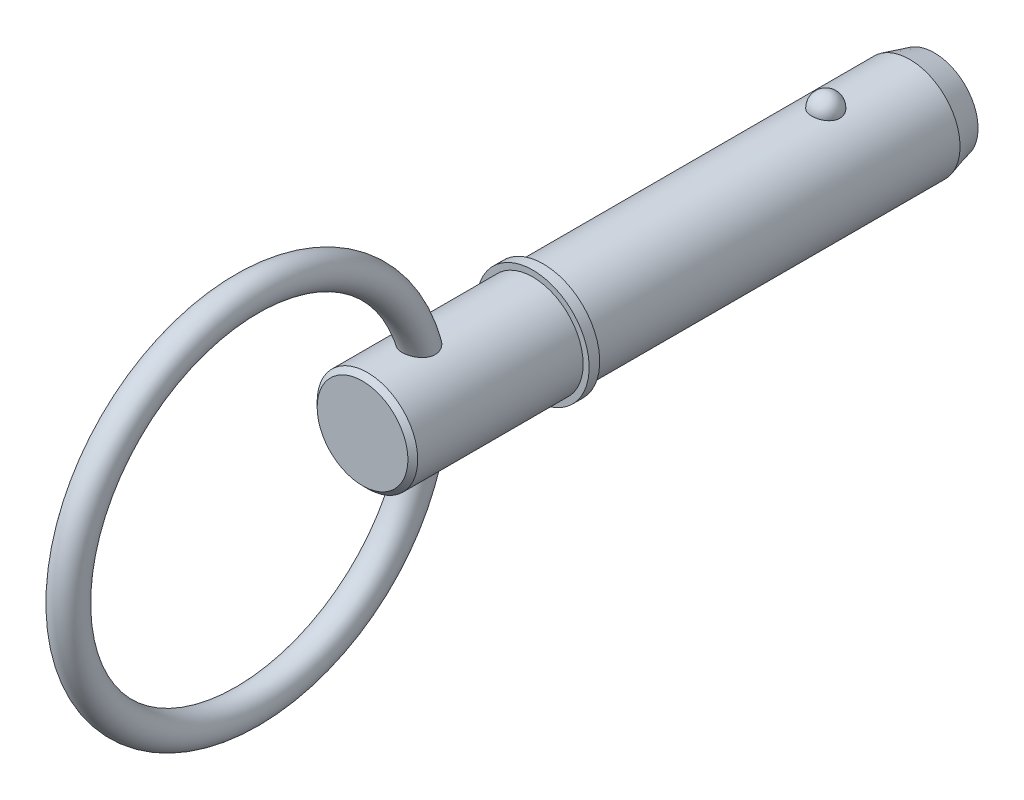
ISO-10303-21;
HEADER;
FILE_DESCRIPTION(('STEP AP214'),'2;1');
FILE_NAME('part.step','',(''),(''),'','','');
FILE_SCHEMA(('AUTOMOTIVE_DESIGN { 1 0 10303 214 1 1 1 1 }'));
ENDSEC;
DATA;
#1=APPLICATION_CONTEXT('core data for automotive mechanical design processes');
#2=APPLICATION_PROTOCOL_DEFINITION('international standard','automotive_design',2000,#1);
#3=PRODUCT_CONTEXT('',#1,'mechanical');
#4=PRODUCT('Part','Part','',(#3));
#5=PRODUCT_RELATED_PRODUCT_CATEGORY('part','',(#4));
#6=PRODUCT_DEFINITION_FORMATION('','',#4);
#7=PRODUCT_DEFINITION_CONTEXT('part definition',#1,'design');
#8=PRODUCT_DEFINITION('design','',#6,#7);
#9=PRODUCT_DEFINITION_SHAPE('','',#8);
#10=(LENGTH_UNIT() NAMED_UNIT(*) SI_UNIT(.MILLI.,.METRE.));
#11=(NAMED_UNIT(*) PLANE_ANGLE_UNIT() SI_UNIT($,.RADIAN.));
#12=(NAMED_UNIT(*) SI_UNIT($,.STERADIAN.) SOLID_ANGLE_UNIT());
#13=UNCERTAINTY_MEASURE_WITH_UNIT(LENGTH_MEASURE(1.E-05),#10,'distance_accuracy_value','');
#14=(GEOMETRIC_REPRESENTATION_CONTEXT(3) GLOBAL_UNCERTAINTY_ASSIGNED_CONTEXT((#13)) GLOBAL_UNIT_ASSIGNED_CONTEXT((#10,
#11,#12)) REPRESENTATION_CONTEXT('',''));
#15=CARTESIAN_POINT('',(0.,0.,0.));
#16=DIRECTION('',(0.,0.,1.));
#17=DIRECTION('',(1.,0.,0.));
#18=AXIS2_PLACEMENT_3D('',#15,#16,#17);
#19=CARTESIAN_POINT('',(0.,0.,38.1));
#20=DIRECTION('',(0.,0.,-1.));
#21=DIRECTION('',(-1.,0.,0.));
#22=AXIS2_PLACEMENT_3D('',#19,#20,#21);
#23=CYLINDRICAL_SURFACE('',#22,7.145);
#24=CARTESIAN_POINT('',(1.99971637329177,6.85945766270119,-2.02));
#25=CARTESIAN_POINT('',(1.9997145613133,6.85945924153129,-1.9070973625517));
#26=CARTESIAN_POINT('',(1.99051486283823,6.86216053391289,-1.79417185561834));
#27=CARTESIAN_POINT('',(1.95393597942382,6.87266409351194,-1.57152267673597));
#28=CARTESIAN_POINT('',(1.92655029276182,6.88046818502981,-1.46180016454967));
#29=CARTESIAN_POINT('',(1.85429435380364,6.90029063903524,-1.24873107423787));
#30=CARTESIAN_POINT('',(1.80943177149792,6.91230715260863,-1.14538172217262));
#31=CARTESIAN_POINT('',(1.70333474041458,6.93921158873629,-0.947875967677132));
#32=CARTESIAN_POINT('',(1.64210059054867,6.95409945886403,-0.853719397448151));
#33=CARTESIAN_POINT('',(1.5044381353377,6.98517577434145,-0.676721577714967));
#34=CARTESIAN_POINT('',(1.42793505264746,7.00137037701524,-0.593939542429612));
#35=CARTESIAN_POINT('',(1.26189697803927,7.03319066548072,-0.442536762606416));
#36=CARTESIAN_POINT('',(1.17236198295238,7.04881635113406,-0.373916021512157));
#37=CARTESIAN_POINT('',(0.982932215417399,7.0777121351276,-0.252935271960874));
#38=CARTESIAN_POINT('',(0.883068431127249,7.09098897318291,-0.2005284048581));
#39=CARTESIAN_POINT('',(0.675560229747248,7.11375589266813,-0.113212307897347));
#40=CARTESIAN_POINT('',(0.567916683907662,7.12324639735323,-0.0783011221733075));
#41=CARTESIAN_POINT('',(0.350006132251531,7.13724173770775,-0.0274707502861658));
#42=CARTESIAN_POINT('',(0.239822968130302,7.14183447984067,-0.0112162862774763));
#43=CARTESIAN_POINT('',(0.0181946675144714,7.14583597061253,0.0029679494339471));
#44=CARTESIAN_POINT('',(-0.0932503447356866,7.14524522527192,0.000899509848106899));
#45=CARTESIAN_POINT('',(-0.312527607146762,7.13899247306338,-0.0213331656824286));
#46=CARTESIAN_POINT('',(-0.420388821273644,7.13340426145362,-0.0412340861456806));
#47=CARTESIAN_POINT('',(-0.631141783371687,7.11785474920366,-0.0982040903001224));
#48=CARTESIAN_POINT('',(-0.734033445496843,7.10789337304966,-0.13527347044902));
#49=CARTESIAN_POINT('',(-0.932634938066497,7.08458058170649,-0.225826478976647));
#50=CARTESIAN_POINT('',(-1.02829911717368,7.07120963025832,-0.279405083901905));
#51=CARTESIAN_POINT('',(-1.20927180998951,7.04252043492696,-0.401457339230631));
#52=CARTESIAN_POINT('',(-1.29457925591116,7.02720199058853,-0.469932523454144));
#53=CARTESIAN_POINT('',(-1.45423311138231,6.995926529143,-0.62143818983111));
#54=CARTESIAN_POINT('',(-1.5283348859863,6.97996288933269,-0.704725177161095));
#55=CARTESIAN_POINT('',(-1.66169281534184,6.94942414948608,-0.882667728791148));
#56=CARTESIAN_POINT('',(-1.72094789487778,6.93484915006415,-0.977324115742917));
#57=CARTESIAN_POINT('',(-1.82375276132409,6.90853186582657,-1.17661373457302));
#58=CARTESIAN_POINT('',(-1.86711024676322,6.8968248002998,-1.28135093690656));
#59=CARTESIAN_POINT('',(-1.9360425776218,6.87779420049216,-1.49689986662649));
#60=CARTESIAN_POINT('',(-1.96161794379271,6.87047053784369,-1.60771141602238));
#61=CARTESIAN_POINT('',(-1.99427437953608,6.86106309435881,-1.83176258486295));
#62=CARTESIAN_POINT('',(-2.00143373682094,6.8589571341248,-1.9449898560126));
#63=CARTESIAN_POINT('',(-1.99730449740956,6.86016064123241,-2.17107603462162));
#64=CARTESIAN_POINT('',(-1.98601641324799,6.86346995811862,-2.28393495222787));
#65=CARTESIAN_POINT('',(-1.94538181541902,6.87509649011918,-2.5054843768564));
#66=CARTESIAN_POINT('',(-1.91612773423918,6.88338806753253,-2.61419321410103));
#67=CARTESIAN_POINT('',(-1.84036449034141,6.90402888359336,-2.8250124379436));
#68=CARTESIAN_POINT('',(-1.79385462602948,6.91637828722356,-2.92712255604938));
#69=CARTESIAN_POINT('',(-1.68442067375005,6.94384180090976,-3.12247704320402));
#70=CARTESIAN_POINT('',(-1.62140729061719,6.95897081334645,-3.21566929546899));
#71=CARTESIAN_POINT('',(-1.4806650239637,6.99026742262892,-3.38999412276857));
#72=CARTESIAN_POINT('',(-1.40293556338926,7.00643506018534,-3.47112622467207));
#73=CARTESIAN_POINT('',(-1.2344320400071,7.03807960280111,-3.61938672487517));
#74=CARTESIAN_POINT('',(-1.1436092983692,7.05355363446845,-3.68646046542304));
#75=CARTESIAN_POINT('',(-0.951591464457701,7.08201263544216,-3.80431973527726));
#76=CARTESIAN_POINT('',(-0.850397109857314,7.09499778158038,-3.85510642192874));
#77=CARTESIAN_POINT('',(-0.641823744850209,7.11687679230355,-3.93839532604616));
#78=CARTESIAN_POINT('',(-0.534539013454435,7.1258202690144,-3.97112042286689));
#79=CARTESIAN_POINT('',(-0.315743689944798,7.1388605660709,-4.01830716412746));
#80=CARTESIAN_POINT('',(-0.204233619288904,7.14295798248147,-4.0327710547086));
#81=CARTESIAN_POINT('',(0.0175518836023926,7.14582273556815,-4.04291389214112));
#82=CARTESIAN_POINT('',(0.127809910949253,7.14469090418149,-4.03894819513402));
#83=CARTESIAN_POINT('',(0.346044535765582,7.13745046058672,-4.01315850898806));
#84=CARTESIAN_POINT('',(0.454021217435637,7.13134203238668,-3.99133518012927));
#85=CARTESIAN_POINT('',(0.664227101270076,7.11483713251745,-3.93057164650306));
#86=CARTESIAN_POINT('',(0.76647723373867,7.10445761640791,-3.89169908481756));
#87=CARTESIAN_POINT('',(0.962929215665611,7.08050813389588,-3.79792023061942));
#88=CARTESIAN_POINT('',(1.05713054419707,7.06693796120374,-3.7430129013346));
#89=CARTESIAN_POINT('',(1.23644031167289,7.03780007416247,-3.61765173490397));
#90=CARTESIAN_POINT('',(1.32138387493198,7.0222044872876,-3.54696861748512));
#91=CARTESIAN_POINT('',(1.47830582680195,6.99085504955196,-3.39245228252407));
#92=CARTESIAN_POINT('',(1.55028198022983,6.97510117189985,-3.30861680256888));
#93=CARTESIAN_POINT('',(1.68063701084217,6.94485803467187,-3.12843058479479));
#94=CARTESIAN_POINT('',(1.73875175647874,6.93039619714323,-3.03188405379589));
#95=CARTESIAN_POINT('',(1.83823393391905,6.90467783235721,-2.83015210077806));
#96=CARTESIAN_POINT('',(1.87960712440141,6.89342020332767,-2.72496966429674));
#97=CARTESIAN_POINT('',(1.94111647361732,6.87633596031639,-2.52050234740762));
#98=CARTESIAN_POINT('',(1.96305249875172,6.87005682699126,-2.42179225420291));
#99=CARTESIAN_POINT('',(1.99235308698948,6.86161702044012,-2.22206084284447));
#100=CARTESIAN_POINT('',(1.99971799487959,6.85945624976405,-2.12103957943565));
#101=CARTESIAN_POINT('',(1.99971637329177,6.85945766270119,-2.02));
#102=B_SPLINE_CURVE_WITH_KNOTS('',3,(#24,#25,#26,#27,#28,#29,#30,#31,#32,#33,#34,#35,#36,#37,
#38,#39,#40,#41,#42,#43,#44,#45,#46,#47,#48,#49,#50,#51,#52,#53,#54,#55,#56,#57,#58,#59,#60,#61,
#62,#63,#64,#65,#66,#67,#68,#69,#70,#71,#72,#73,#74,#75,#76,#77,#78,#79,#80,#81,#82,#83,#84,#85,
#86,#87,#88,#89,#90,#91,#92,#93,#94,#95,#96,#97,#98,#99,#100,#101),.UNSPECIFIED.,.T.,.F.,(4,2,2,
2,2,2,2,2,2,2,2,2,2,2,2,2,2,2,2,2,2,2,2,2,2,2,2,2,2,2,2,2,2,2,2,2,2,2,4),(0.,0.338345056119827,
0.67681114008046,1.01512885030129,1.35344038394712,1.69345130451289,2.0334623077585,
2.37248128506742,2.71146235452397,3.04425125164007,3.37700766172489,3.70493009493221,
4.03285819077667,4.36270921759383,4.69259422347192,5.02887632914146,5.36518278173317,
5.70543263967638,6.04567253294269,6.38446363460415,6.72324532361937,7.0602984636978,
7.39736530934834,7.73629500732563,8.07523799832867,8.4154752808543,8.75568838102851,
9.09160363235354,9.42747756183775,9.7569023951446,10.0863150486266,10.4144324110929,
10.7425709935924,11.0758313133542,11.4091490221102,11.748385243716,12.0875046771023,
12.3903058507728,12.6930998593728),.UNSPECIFIED.);
#103=CARTESIAN_POINT('',(1.99971637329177,6.85945766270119,-2.02));
#104=VERTEX_POINT('',#103);
#105=EDGE_CURVE('E103',#104,#104,#102,.T.);
#106=ORIENTED_EDGE('',*,*,#105,.T.);
#107=EDGE_LOOP('',(#106));
#108=FACE_BOUND('',#107,.T.);
#109=CARTESIAN_POINT('',(0.,0.,-13.95));
#110=DIRECTION('',(0.,0.,-1.));
#111=DIRECTION('',(-1.,0.,0.));
#112=AXIS2_PLACEMENT_3D('',#109,#110,#111);
#113=CIRCLE('',#112,7.145);
#114=CARTESIAN_POINT('',(-7.145,0.,-13.95));
#115=VERTEX_POINT('',#114);
#116=EDGE_CURVE('E110',#115,#115,#113,.F.);
#117=ORIENTED_EDGE('',*,*,#116,.T.);
#118=EDGE_LOOP('',(#117));
#119=FACE_BOUND('',#118,.T.);
#120=CARTESIAN_POINT('',(0.,0.,38.1));
#121=DIRECTION('',(0.,0.,1.));
#122=DIRECTION('',(1.,0.,0.));
#123=AXIS2_PLACEMENT_3D('',#120,#121,#122);
#124=CIRCLE('',#123,7.145);
#125=CARTESIAN_POINT('',(7.145,0.,38.1));
#126=VERTEX_POINT('',#125);
#127=EDGE_CURVE('E108',#126,#126,#124,.T.);
#128=ORIENTED_EDGE('',*,*,#127,.F.);
#129=EDGE_LOOP('',(#128));
#130=FACE_BOUND('',#129,.T.);
#131=ADVANCED_FACE('F39',(#108,#119,#130),#23,.T.);
#132=CARTESIAN_POINT('',(0.,0.,-17.45));
#133=DIRECTION('',(0.,0.,-1.));
#134=DIRECTION('',(-1.,0.,0.));
#135=AXIS2_PLACEMENT_3D('',#132,#133,#134);
#136=PLANE('',#135);
#137=CARTESIAN_POINT('',(0.,0.,-17.45));
#138=DIRECTION('',(0.,0.,-1.));
#139=DIRECTION('',(-1.,0.,0.));
#140=AXIS2_PLACEMENT_3D('',#137,#138,#139);
#141=CIRCLE('',#140,6.20717782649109);
#142=CARTESIAN_POINT('',(-6.20717782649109,0.,-17.45));
#143=VERTEX_POINT('',#142);
#144=EDGE_CURVE('E142',#143,#143,#141,.T.);
#145=ORIENTED_EDGE('',*,*,#144,.T.);
#146=EDGE_LOOP('',(#145));
#147=FACE_BOUND('',#146,.T.);
#148=ADVANCED_FACE('F89',(#147),#136,.T.);
#149=CARTESIAN_POINT('',(0.,0.,-17.45));
#150=DIRECTION('',(0.,0.,1.));
#151=DIRECTION('',(1.,0.,0.));
#152=AXIS2_PLACEMENT_3D('',#149,#150,#151);
#153=CONICAL_SURFACE('',#152,6.20717782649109,0.261799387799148);
#154=ORIENTED_EDGE('',*,*,#116,.F.);
#155=EDGE_LOOP('',(#154));
#156=FACE_BOUND('',#155,.T.);
#157=ORIENTED_EDGE('',*,*,#144,.F.);
#158=EDGE_LOOP('',(#157));
#159=FACE_BOUND('',#158,.T.);
#160=ADVANCED_FACE('F95',(#156,#159),#153,.T.);
#161=CARTESIAN_POINT('',(0.,7.145,-2.02));
#162=DIRECTION('',(0.,1.,0.));
#163=DIRECTION('',(0.,0.,1.));
#164=AXIS2_PLACEMENT_3D('',#161,#162,#163);
#165=SPHERICAL_SURFACE('',#164,2.02);
#166=ORIENTED_EDGE('',*,*,#105,.F.);
#167=EDGE_LOOP('',(#166));
#168=FACE_BOUND('',#167,.T.);
#169=ADVANCED_FACE('F113',(#168),#165,.T.);
#170=CARTESIAN_POINT('',(0.,0.,38.1));
#171=DIRECTION('',(0.,0.,-1.));
#172=DIRECTION('',(-1.,0.,0.));
#173=AXIS2_PLACEMENT_3D('',#170,#171,#172);
#174=PLANE('',#173);
#175=ORIENTED_EDGE('',*,*,#127,.T.);
#176=EDGE_LOOP('',(#175));
#177=FACE_BOUND('',#176,.T.);
#178=CARTESIAN_POINT('',(0.,0.,38.1));
#179=DIRECTION('',(0.,0.,-1.));
#180=DIRECTION('',(-1.,0.,0.));
#181=AXIS2_PLACEMENT_3D('',#178,#179,#180);
#182=CIRCLE('',#181,8.);
#183=CARTESIAN_POINT('',(-8.,0.,38.1));
#184=VERTEX_POINT('',#183);
#185=EDGE_CURVE('E109',#184,#184,#182,.T.);
#186=ORIENTED_EDGE('',*,*,#185,.T.);
#187=EDGE_LOOP('',(#186));
#188=FACE_BOUND('',#187,.T.);
#189=ADVANCED_FACE('F117',(#177,#188),#174,.T.);
#190=CARTESIAN_POINT('',(0.,0.,33.7287874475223));
#191=DIRECTION('',(0.,0.,-1.));
#192=DIRECTION('',(-1.,0.,0.));
#193=AXIS2_PLACEMENT_3D('',#190,#191,#192);
#194=CYLINDRICAL_SURFACE('',#193,8.);
#195=CARTESIAN_POINT('',(0.,0.,39.6));
#196=DIRECTION('',(0.,0.,-1.));
#197=DIRECTION('',(-1.,0.,0.));
#198=AXIS2_PLACEMENT_3D('',#195,#196,#197);
#199=CIRCLE('',#198,8.);
#200=CARTESIAN_POINT('',(-8.,0.,39.6));
#201=VERTEX_POINT('',#200);
#202=EDGE_CURVE('E134',#201,#201,#199,.T.);
#203=ORIENTED_EDGE('',*,*,#202,.T.);
#204=EDGE_LOOP('',(#203));
#205=FACE_BOUND('',#204,.T.);
#206=ORIENTED_EDGE('',*,*,#185,.F.);
#207=EDGE_LOOP('',(#206));
#208=FACE_BOUND('',#207,.T.);
#209=ADVANCED_FACE('F121',(#205,#208),#194,.T.);
#210=CARTESIAN_POINT('',(0.,8.,39.6));
#211=DIRECTION('',(0.,0.,1.));
#212=DIRECTION('',(1.,0.,0.));
#213=AXIS2_PLACEMENT_3D('',#210,#211,#212);
#214=PLANE('',#213);
#215=CARTESIAN_POINT('',(0.,0.,39.6));
#216=DIRECTION('',(0.,0.,1.));
#217=DIRECTION('',(1.,0.,0.));
#218=AXIS2_PLACEMENT_3D('',#215,#216,#217);
#219=CIRCLE('',#218,7.145);
#220=CARTESIAN_POINT('',(7.145,0.,39.6));
#221=VERTEX_POINT('',#220);
#222=EDGE_CURVE('E112',#221,#221,#219,.T.);
#223=ORIENTED_EDGE('',*,*,#222,.F.);
#224=EDGE_LOOP('',(#223));
#225=FACE_BOUND('',#224,.T.);
#226=ORIENTED_EDGE('',*,*,#202,.F.);
#227=EDGE_LOOP('',(#226));
#228=FACE_BOUND('',#227,.T.);
#229=ADVANCED_FACE('F86',(#225,#228),#214,.T.);
#230=CARTESIAN_POINT('',(0.,0.,63.8));
#231=DIRECTION('',(0.,0.,-1.));
#232=DIRECTION('',(-1.,0.,0.));
#233=AXIS2_PLACEMENT_3D('',#230,#231,#232);
#234=CYLINDRICAL_SURFACE('',#233,7.145);
#235=CARTESIAN_POINT('',(-1.03551034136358,-7.0695645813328,53.7302593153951));
#236=CARTESIAN_POINT('',(-0.923225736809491,-7.08601142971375,53.674402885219));
#237=CARTESIAN_POINT('',(-0.806039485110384,-7.10042113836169,53.6278354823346));
#238=CARTESIAN_POINT('',(-0.565173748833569,-7.1236385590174,53.5542799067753));
#239=CARTESIAN_POINT('',(-0.441495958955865,-7.13244772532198,53.5272866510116));
#240=CARTESIAN_POINT('',(-0.191106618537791,-7.14354309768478,53.4934505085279));
#241=CARTESIAN_POINT('',(-0.0643945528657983,-7.14582818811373,53.486611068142));
#242=CARTESIAN_POINT('',(0.188443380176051,-7.14363337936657,53.4932414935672));
#243=CARTESIAN_POINT('',(0.314569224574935,-7.13915321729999,53.5067121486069));
#244=CARTESIAN_POINT('',(0.562499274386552,-7.12390574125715,53.5536416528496));
#245=CARTESIAN_POINT('',(0.684308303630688,-7.11314569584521,53.5870773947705));
#246=CARTESIAN_POINT('',(0.920329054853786,-7.08647538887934,53.673194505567));
#247=CARTESIAN_POINT('',(1.03454038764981,-7.07056486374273,53.7258768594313));
#248=CARTESIAN_POINT('',(1.25232634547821,-7.03526161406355,53.8494470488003));
#249=CARTESIAN_POINT('',(1.35588248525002,-7.01586299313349,53.9203658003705));
#250=CARTESIAN_POINT('',(1.54916093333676,-6.9757352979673,54.0787573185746));
#251=CARTESIAN_POINT('',(1.63888414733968,-6.95500631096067,54.1662290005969));
#252=CARTESIAN_POINT('',(1.80113983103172,-6.91475703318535,54.3547277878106));
#253=CARTESIAN_POINT('',(1.8738192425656,-6.89522757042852,54.4556263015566));
#254=CARTESIAN_POINT('',(2.00091178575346,-6.85942834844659,54.66884010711));
#255=CARTESIAN_POINT('',(2.05532963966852,-6.8431577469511,54.7811524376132));
#256=CARTESIAN_POINT('',(2.14350100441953,-6.81604873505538,55.0111948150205));
#257=CARTESIAN_POINT('',(2.17770329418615,-6.80509340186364,55.1287395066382));
#258=CARTESIAN_POINT('',(2.2269139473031,-6.7891497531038,55.368149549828));
#259=CARTESIAN_POINT('',(2.2419216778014,-6.7841616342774,55.4900150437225));
#260=CARTESIAN_POINT('',(2.25313992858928,-6.78044381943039,55.7358069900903));
#261=CARTESIAN_POINT('',(2.24917302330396,-6.78177319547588,55.8597420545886));
#262=CARTESIAN_POINT('',(2.22301329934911,-6.79039131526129,56.1054389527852));
#263=CARTESIAN_POINT('',(2.20081491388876,-6.79768187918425,56.2272001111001));
#264=CARTESIAN_POINT('',(2.13702421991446,-6.81801706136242,56.4752873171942));
#265=CARTESIAN_POINT('',(2.09404815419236,-6.83146790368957,56.6012230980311));
#266=CARTESIAN_POINT('',(1.9898638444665,-6.86253672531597,56.8448244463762));
#267=CARTESIAN_POINT('',(1.92864130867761,-6.88015796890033,56.9624834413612));
#268=CARTESIAN_POINT('',(1.78274362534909,-6.91947130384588,57.1974979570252));
#269=CARTESIAN_POINT('',(1.6964070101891,-6.94139021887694,57.3137892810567));
#270=CARTESIAN_POINT('',(1.50503944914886,-6.98537683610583,57.5297996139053));
#271=CARTESIAN_POINT('',(1.40001969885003,-7.00744444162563,57.629528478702));
#272=CARTESIAN_POINT('',(1.19221781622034,-7.04548349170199,57.793170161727));
#273=CARTESIAN_POINT('',(1.09203347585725,-7.06185586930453,57.8602859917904));
#274=CARTESIAN_POINT('',(0.881607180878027,-7.09119477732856,57.977337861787));
#275=CARTESIAN_POINT('',(0.771372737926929,-7.10416382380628,58.0272866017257));
#276=CARTESIAN_POINT('',(0.542622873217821,-7.12529560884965,58.1074752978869));
#277=CARTESIAN_POINT('',(0.424058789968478,-7.13342692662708,58.1375865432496));
#278=CARTESIAN_POINT('',(0.183155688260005,-7.14366628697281,58.175370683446));
#279=CARTESIAN_POINT('',(0.0608191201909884,-7.14577815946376,58.183057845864));
#280=CARTESIAN_POINT('',(-0.169367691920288,-7.14381572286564,58.1758601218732));
#281=CARTESIAN_POINT('',(-0.277308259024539,-7.14040669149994,58.1634029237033));
#282=CARTESIAN_POINT('',(-0.489468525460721,-7.12900651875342,58.1211569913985));
#283=CARTESIAN_POINT('',(-0.593687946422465,-7.12101503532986,58.0913669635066));
#284=CARTESIAN_POINT('',(-0.796149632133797,-7.10123695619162,58.0159872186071));
#285=CARTESIAN_POINT('',(-0.894373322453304,-7.08943921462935,57.9703510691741));
#286=CARTESIAN_POINT('',(-1.08274371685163,-7.06312621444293,57.8653366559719));
#287=CARTESIAN_POINT('',(-1.17288754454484,-7.04860999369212,57.8059535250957));
#288=CARTESIAN_POINT('',(-1.35484961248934,-7.01605385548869,57.6671134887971));
#289=CARTESIAN_POINT('',(-1.44541008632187,-6.99780069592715,57.5860611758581));
#290=CARTESIAN_POINT('',(-1.61364655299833,-6.96093393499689,57.4115990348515));
#291=CARTESIAN_POINT('',(-1.69131381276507,-6.94232009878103,57.3181809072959));
#292=CARTESIAN_POINT('',(-1.84330074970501,-6.90364386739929,57.1066087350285));
#293=CARTESIAN_POINT('',(-1.91543090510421,-6.88377370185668,56.9868392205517));
#294=CARTESIAN_POINT('',(-2.0400294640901,-6.84788436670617,56.7368759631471));
#295=CARTESIAN_POINT('',(-2.09248830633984,-6.83186707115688,56.6066771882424));
#296=CARTESIAN_POINT('',(-2.17795964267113,-6.80511869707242,56.3325553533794));
#297=CARTESIAN_POINT('',(-2.20992909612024,-6.79467512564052,56.1882740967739));
#298=CARTESIAN_POINT('',(-2.24813111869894,-6.78213595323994,55.8959843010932));
#299=CARTESIAN_POINT('',(-2.25438316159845,-6.78003403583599,55.7479786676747));
#300=CARTESIAN_POINT('',(-2.24011368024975,-6.78475868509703,55.465430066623));
#301=CARTESIAN_POINT('',(-2.22172362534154,-6.79087455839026,55.3307692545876));
#302=CARTESIAN_POINT('',(-2.16145328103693,-6.81029672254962,55.0673673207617));
#303=CARTESIAN_POINT('',(-2.11958615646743,-6.82359898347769,54.9386229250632));
#304=CARTESIAN_POINT('',(-2.01784121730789,-6.85433303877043,54.7022679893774));
#305=CARTESIAN_POINT('',(-1.9598239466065,-6.8713108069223,54.5937922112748));
#306=CARTESIAN_POINT('',(-1.82642155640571,-6.90796511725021,54.3885914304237));
#307=CARTESIAN_POINT('',(-1.75103235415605,-6.92764229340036,54.2918691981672));
#308=CARTESIAN_POINT('',(-1.57825515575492,-6.96911949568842,54.1054086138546));
#309=CARTESIAN_POINT('',(-1.47957996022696,-6.99096237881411,54.0168703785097));
#310=CARTESIAN_POINT('',(-1.26760341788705,-7.0324852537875,53.858840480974));
#311=CARTESIAN_POINT('',(-1.15429989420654,-7.05216492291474,53.7893516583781));
#312=CARTESIAN_POINT('',(-1.03551034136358,-7.0695645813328,53.7302593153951));
#313=B_SPLINE_CURVE_WITH_KNOTS('',3,(#235,#236,#237,#238,#239,#240,#241,#242,#243,#244,#245,
#246,#247,#248,#249,#250,#251,#252,#253,#254,#255,#256,#257,#258,#259,#260,#261,#262,#263,#264,
#265,#266,#267,#268,#269,#270,#271,#272,#273,#274,#275,#276,#277,#278,#279,#280,#281,#282,#283,
#284,#285,#286,#287,#288,#289,#290,#291,#292,#293,#294,#295,#296,#297,#298,#299,#300,#301,#302,
#303,#304,#305,#306,#307,#308,#309,#310,#311,#312),.UNSPECIFIED.,.T.,.F.,(4,2,2,2,2,2,2,2,2,2,2,
2,2,2,2,2,2,2,2,2,2,2,2,2,2,2,2,2,2,2,2,2,2,2,2,2,2,2,4),(0.,0.378979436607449,
0.757860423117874,1.13680619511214,1.51576669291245,1.89428943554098,2.2728315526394,
2.65201969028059,3.03118299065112,3.40694616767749,3.78261210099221,4.1495904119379,
4.51658082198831,4.8870095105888,5.25755134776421,5.65713708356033,6.05703662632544,
6.49445595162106,6.93161403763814,7.29520224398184,7.65852089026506,8.02417421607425,
8.38959483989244,8.71415763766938,9.03874466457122,9.36429093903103,9.68995264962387,
10.0572255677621,10.4247462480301,10.8465602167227,11.2685789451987,11.7106604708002,
12.152407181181,12.5583067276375,12.9639788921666,13.3347314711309,13.7055712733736,
14.1064462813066,14.5073810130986),.UNSPECIFIED.);
#314=CARTESIAN_POINT('',(-1.03551034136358,-7.0695645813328,53.7302593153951));
#315=VERTEX_POINT('',#314);
#316=EDGE_CURVE('E10',#315,#315,#313,.T.);
#317=ORIENTED_EDGE('',*,*,#316,.F.);
#318=EDGE_LOOP('',(#317));
#319=FACE_BOUND('',#318,.T.);
#320=CARTESIAN_POINT('',(-1.03551034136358,7.0695645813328,53.7302593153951));
#321=CARTESIAN_POINT('',(-1.14644953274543,7.05331457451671,53.785446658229));
#322=CARTESIAN_POINT('',(-1.25260902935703,7.03507806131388,53.8497022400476));
#323=CARTESIAN_POINT('',(-1.45240021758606,6.99656564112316,53.9949589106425));
#324=CARTESIAN_POINT('',(-1.54602879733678,6.97628922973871,54.0759641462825));
#325=CARTESIAN_POINT('',(-1.71815091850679,6.93590796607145,54.2529100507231));
#326=CARTESIAN_POINT('',(-1.79663177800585,6.91580327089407,54.3488631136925));
#327=CARTESIAN_POINT('',(-1.9360771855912,6.87807159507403,54.5531625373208));
#328=CARTESIAN_POINT('',(-1.99704642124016,6.86044395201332,54.6615055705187));
#329=CARTESIAN_POINT('',(-2.09894945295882,6.82995115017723,54.8855428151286));
#330=CARTESIAN_POINT('',(-2.14021253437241,6.81700866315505,55.0010768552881));
#331=CARTESIAN_POINT('',(-2.20347311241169,6.79682602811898,55.2377588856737));
#332=CARTESIAN_POINT('',(-2.22547114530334,6.78958572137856,55.3589067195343));
#333=CARTESIAN_POINT('',(-2.25026114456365,6.78140983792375,55.6032142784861));
#334=CARTESIAN_POINT('',(-2.25306986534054,6.78046876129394,55.7263721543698));
#335=CARTESIAN_POINT('',(-2.2403056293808,6.78469532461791,55.9716049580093));
#336=CARTESIAN_POINT('',(-2.22472720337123,6.78986478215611,56.0936795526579));
#337=CARTESIAN_POINT('',(-2.1747213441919,6.8060520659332,56.3420367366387));
#338=CARTESIAN_POINT('',(-2.13910164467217,6.81743831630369,56.4680537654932));
#339=CARTESIAN_POINT('',(-2.04975058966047,6.84483151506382,56.7129736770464));
#340=CARTESIAN_POINT('',(-1.99600968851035,6.86084089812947,56.8318727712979));
#341=CARTESIAN_POINT('',(-1.86558545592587,6.89751014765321,57.0714258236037));
#342=CARTESIAN_POINT('',(-1.78715729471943,6.91847353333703,57.1910877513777));
#343=CARTESIAN_POINT('',(-1.61149373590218,6.96148580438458,57.4156460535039));
#344=CARTESIAN_POINT('',(-1.51424701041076,6.98353533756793,57.5205334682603));
#345=CARTESIAN_POINT('',(-1.30107590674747,7.02639179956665,57.7129518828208));
#346=CARTESIAN_POINT('',(-1.18492282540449,7.04717858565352,57.8002366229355));
#347=CARTESIAN_POINT('',(-0.93739281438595,7.08434208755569,57.9508275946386));
#348=CARTESIAN_POINT('',(-0.806039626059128,7.10072555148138,58.0141705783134));
#349=CARTESIAN_POINT('',(-0.55047080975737,7.12475629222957,58.1054837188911));
#350=CARTESIAN_POINT('',(-0.427643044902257,7.13327781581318,58.1370470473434));
#351=CARTESIAN_POINT('',(-0.24055628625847,7.14122488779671,58.1663563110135));
#352=CARTESIAN_POINT('',(-0.17771410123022,7.14306799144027,58.1731199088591));
#353=CARTESIAN_POINT('',(-0.0516470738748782,7.14509121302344,58.1805390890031));
#354=CARTESIAN_POINT('',(0.0115777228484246,7.14527152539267,58.1811953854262));
#355=CARTESIAN_POINT('',(0.182932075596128,7.14347436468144,58.1746165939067));
#356=CARTESIAN_POINT('',(0.290871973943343,7.13986325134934,58.1614086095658));
#357=CARTESIAN_POINT('',(0.502842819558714,7.1280769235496,58.1176904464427));
#358=CARTESIAN_POINT('',(0.606873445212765,7.11990133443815,58.0871788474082));
#359=CARTESIAN_POINT('',(0.809001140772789,7.09978218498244,58.0103786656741));
#360=CARTESIAN_POINT('',(0.907071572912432,7.08782300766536,57.9640246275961));
#361=CARTESIAN_POINT('',(1.09503957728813,7.0612282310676,57.8576208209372));
#362=CARTESIAN_POINT('',(1.18493426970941,7.04659169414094,57.7975662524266));
#363=CARTESIAN_POINT('',(1.36644041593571,7.01380352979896,57.6572339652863));
#364=CARTESIAN_POINT('',(1.45676563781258,6.99544216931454,57.5753442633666));
#365=CARTESIAN_POINT('',(1.6244063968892,6.95842750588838,57.3992310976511));
#366=CARTESIAN_POINT('',(1.70171298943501,6.93977401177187,57.3049992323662));
#367=CARTESIAN_POINT('',(1.85271606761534,6.90111647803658,57.0918074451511));
#368=CARTESIAN_POINT('',(1.92421731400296,6.88131605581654,56.9712480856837));
#369=CARTESIAN_POINT('',(2.04739198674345,6.84567995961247,56.7197850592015));
#370=CARTESIAN_POINT('',(2.09905621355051,6.82984612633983,56.5888766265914));
#371=CARTESIAN_POINT('',(2.18257767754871,6.80363167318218,56.3138472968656));
#372=CARTESIAN_POINT('',(2.21345394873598,6.79352430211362,56.1693978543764));
#373=CARTESIAN_POINT('',(2.24941288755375,6.78170753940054,55.8769846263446));
#374=CARTESIAN_POINT('',(2.2545156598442,6.77999160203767,55.7290236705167));
#375=CARTESIAN_POINT('',(2.2380435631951,6.78544298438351,55.4470530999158));
#376=CARTESIAN_POINT('',(2.21864521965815,6.79188566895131,55.3129037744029));
#377=CARTESIAN_POINT('',(2.1564876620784,6.81187529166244,55.0506903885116));
#378=CARTESIAN_POINT('',(2.11373989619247,6.82541874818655,54.9226233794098));
#379=CARTESIAN_POINT('',(2.01040099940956,6.85652522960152,54.6875077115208));
#380=CARTESIAN_POINT('',(1.95162600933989,6.87365110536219,54.5795975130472));
#381=CARTESIAN_POINT('',(1.81683142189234,6.91050025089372,54.3756496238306));
#382=CARTESIAN_POINT('',(1.74081238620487,6.93022343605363,54.2796115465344));
#383=CARTESIAN_POINT('',(1.57431234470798,6.96992220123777,54.1025418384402));
#384=CARTESIAN_POINT('',(1.48394688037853,6.98989467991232,54.021400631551));
#385=CARTESIAN_POINT('',(1.29081365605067,7.02812243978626,53.8750381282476));
#386=CARTESIAN_POINT('',(1.18804491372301,7.04637758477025,53.8098180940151));
#387=CARTESIAN_POINT('',(0.970386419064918,7.07967210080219,53.6953776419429));
#388=CARTESIAN_POINT('',(0.855272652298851,7.09462807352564,53.6465586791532));
#389=CARTESIAN_POINT('',(0.618143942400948,7.11920826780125,53.5680711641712));
#390=CARTESIAN_POINT('',(0.496128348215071,7.12883198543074,53.5384044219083));
#391=CARTESIAN_POINT('',(0.247581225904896,7.14180209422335,53.4986987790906));
#392=CARTESIAN_POINT('',(0.121020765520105,7.14509609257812,53.4888236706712));
#393=CARTESIAN_POINT('',(-0.132022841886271,7.14489967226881,53.4894154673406));
#394=CARTESIAN_POINT('',(-0.258506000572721,7.14141109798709,53.4998768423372));
#395=CARTESIAN_POINT('',(-0.496649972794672,7.12862600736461,53.5390533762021));
#396=CARTESIAN_POINT('',(-0.608625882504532,7.11987587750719,53.5660553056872));
#397=CARTESIAN_POINT('',(-0.826925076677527,7.09783467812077,53.6362228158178));
#398=CARTESIAN_POINT('',(-0.933248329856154,7.08454358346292,53.6793884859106));
#399=CARTESIAN_POINT('',(-1.03551034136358,7.0695645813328,53.7302593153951));
#400=B_SPLINE_CURVE_WITH_KNOTS('',3,(#320,#321,#322,#323,#324,#325,#326,#327,#328,#329,#330,
#331,#332,#333,#334,#335,#336,#337,#338,#339,#340,#341,#342,#343,#344,#345,#346,#347,#348,#349,
#350,#351,#352,#353,#354,#355,#356,#357,#358,#359,#360,#361,#362,#363,#364,#365,#366,#367,#368,
#369,#370,#371,#372,#373,#374,#375,#376,#377,#378,#379,#380,#381,#382,#383,#384,#385,#386,#387,
#388,#389,#390,#391,#392,#393,#394,#395,#396,#397,#398,#399),.UNSPECIFIED.,.T.,.F.,(4,2,2,2,2,2,
2,2,2,2,2,2,2,2,2,2,2,2,2,2,2,2,2,2,2,2,2,2,2,2,2,2,2,2,2,2,2,2,2,4),(0.,0.37450428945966,
0.749101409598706,1.12401080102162,1.49881974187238,1.86712525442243,2.23542051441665,
2.60339417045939,2.97147730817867,3.36420696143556,3.7571438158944,4.18898920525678,
4.62109535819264,5.05888124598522,5.49599234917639,5.87475353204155,6.06416800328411,
6.25356032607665,6.57826179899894,6.90298992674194,7.22907626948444,7.55527703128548,
7.92373585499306,8.29244681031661,8.71527472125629,9.13829848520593,9.58009907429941,
10.0215549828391,10.4264139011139,10.831074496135,11.2014904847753,11.571894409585,
11.9394538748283,12.3070424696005,12.6830655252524,13.0591241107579,13.4382822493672,
13.8173372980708,14.1625475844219,14.5077597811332),.UNSPECIFIED.);
#401=CARTESIAN_POINT('',(-1.03551034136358,7.0695645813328,53.7302593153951));
#402=VERTEX_POINT('',#401);
#403=EDGE_CURVE('E51',#402,#402,#400,.T.);
#404=ORIENTED_EDGE('',*,*,#403,.F.);
#405=EDGE_LOOP('',(#404));
#406=FACE_BOUND('',#405,.T.);
#407=CARTESIAN_POINT('',(0.,0.,63.0999999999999));
#408=DIRECTION('',(0.,0.,-1.));
#409=DIRECTION('',(-1.,0.,0.));
#410=AXIS2_PLACEMENT_3D('',#407,#408,#409);
#411=CIRCLE('',#410,7.145);
#412=CARTESIAN_POINT('',(-7.14499999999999,0.,63.1));
#413=VERTEX_POINT('',#412);
#414=EDGE_CURVE('E65',#413,#413,#411,.T.);
#415=ORIENTED_EDGE('',*,*,#414,.T.);
#416=EDGE_LOOP('',(#415));
#417=FACE_BOUND('',#416,.T.);
#418=ORIENTED_EDGE('',*,*,#222,.T.);
#419=EDGE_LOOP('',(#418));
#420=FACE_BOUND('',#419,.T.);
#421=ADVANCED_FACE('F70',(#319,#406,#417,#420),#234,.T.);
#422=CARTESIAN_POINT('',(0.,0.,63.8));
#423=DIRECTION('',(0.,0.,-1.));
#424=DIRECTION('',(-1.,0.,0.));
#425=AXIS2_PLACEMENT_3D('',#422,#423,#424);
#426=PLANE('',#425);
#427=CARTESIAN_POINT('',(0.,0.,63.8));
#428=DIRECTION('',(0.,0.,-1.));
#429=DIRECTION('',(-1.,0.,0.));
#430=AXIS2_PLACEMENT_3D('',#427,#428,#429);
#431=CIRCLE('',#430,6.44499999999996);
#432=CARTESIAN_POINT('',(-6.44499999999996,0.,63.8));
#433=VERTEX_POINT('',#432);
#434=EDGE_CURVE('E58',#433,#433,#431,.F.);
#435=ORIENTED_EDGE('',*,*,#434,.T.);
#436=EDGE_LOOP('',(#435));
#437=FACE_BOUND('',#436,.T.);
#438=ADVANCED_FACE('F77',(#437),#426,.F.);
#439=CARTESIAN_POINT('',(0.,0.,63.0999999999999));
#440=DIRECTION('',(0.,0.,-1.));
#441=DIRECTION('',(-1.,0.,0.));
#442=AXIS2_PLACEMENT_3D('',#439,#440,#441);
#443=CONICAL_SURFACE('',#442,7.145,0.78539816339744);
#444=CARTESIAN_POINT('',(-6.44499999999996,0.,63.8));
#445=CARTESIAN_POINT('',(-6.45229166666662,0.,63.7927083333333));
#446=CARTESIAN_POINT('',(-6.45958333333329,0.,63.7854166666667));
#447=CARTESIAN_POINT('',(-6.47416666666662,0.,63.7708333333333));
#448=CARTESIAN_POINT('',(-6.48145833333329,0.,63.7635416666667));
#449=CARTESIAN_POINT('',(-6.49604166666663,0.,63.7489583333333));
#450=CARTESIAN_POINT('',(-6.50333333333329,0.,63.7416666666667));
#451=CARTESIAN_POINT('',(-6.51791666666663,0.,63.7270833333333));
#452=CARTESIAN_POINT('',(-6.52520833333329,0.,63.7197916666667));
#453=CARTESIAN_POINT('',(-6.53979166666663,0.,63.7052083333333));
#454=CARTESIAN_POINT('',(-6.5470833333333,0.,63.6979166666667));
#455=CARTESIAN_POINT('',(-6.56166666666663,0.,63.6833333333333));
#456=CARTESIAN_POINT('',(-6.5689583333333,0.,63.6760416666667));
#457=CARTESIAN_POINT('',(-6.58354166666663,0.,63.6614583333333));
#458=CARTESIAN_POINT('',(-6.5908333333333,0.,63.6541666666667));
#459=CARTESIAN_POINT('',(-6.60541666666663,0.,63.6395833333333));
#460=CARTESIAN_POINT('',(-6.6127083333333,0.,63.6322916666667));
#461=CARTESIAN_POINT('',(-6.62729166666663,0.,63.6177083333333));
#462=CARTESIAN_POINT('',(-6.6345833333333,0.,63.6104166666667));
#463=CARTESIAN_POINT('',(-6.64916666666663,0.,63.5958333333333));
#464=CARTESIAN_POINT('',(-6.6564583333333,0.,63.5885416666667));
#465=CARTESIAN_POINT('',(-6.67104166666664,0.,63.5739583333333));
#466=CARTESIAN_POINT('',(-6.6783333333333,0.,63.5666666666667));
#467=CARTESIAN_POINT('',(-6.69291666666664,0.,63.5520833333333));
#468=CARTESIAN_POINT('',(-6.7002083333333,0.,63.5447916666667));
#469=CARTESIAN_POINT('',(-6.71479166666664,0.,63.5302083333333));
#470=CARTESIAN_POINT('',(-6.7220833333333,0.,63.5229166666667));
#471=CARTESIAN_POINT('',(-6.73666666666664,0.,63.5083333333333));
#472=CARTESIAN_POINT('',(-6.74395833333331,0.,63.5010416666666));
#473=CARTESIAN_POINT('',(-6.75854166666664,0.,63.4864583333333));
#474=CARTESIAN_POINT('',(-6.76583333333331,0.,63.4791666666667));
#475=CARTESIAN_POINT('',(-6.78041666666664,0.,63.4645833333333));
#476=CARTESIAN_POINT('',(-6.78770833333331,0.,63.4572916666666));
#477=CARTESIAN_POINT('',(-6.80229166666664,0.,63.4427083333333));
#478=CARTESIAN_POINT('',(-6.80958333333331,0.,63.4354166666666));
#479=CARTESIAN_POINT('',(-6.82416666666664,0.,63.4208333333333));
#480=CARTESIAN_POINT('',(-6.83145833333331,0.,63.4135416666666));
#481=CARTESIAN_POINT('',(-6.84604166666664,0.,63.3989583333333));
#482=CARTESIAN_POINT('',(-6.85333333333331,0.,63.3916666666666));
#483=CARTESIAN_POINT('',(-6.86791666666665,0.,63.3770833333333));
#484=CARTESIAN_POINT('',(-6.87520833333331,0.,63.3697916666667));
#485=CARTESIAN_POINT('',(-6.88979166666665,0.,63.3552083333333));
#486=CARTESIAN_POINT('',(-6.89708333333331,0.,63.3479166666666));
#487=CARTESIAN_POINT('',(-6.91166666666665,0.,63.3333333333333));
#488=CARTESIAN_POINT('',(-6.91895833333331,0.,63.3260416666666));
#489=CARTESIAN_POINT('',(-6.93354166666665,0.,63.3114583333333));
#490=CARTESIAN_POINT('',(-6.94083333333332,0.,63.3041666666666));
#491=CARTESIAN_POINT('',(-6.95541666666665,0.,63.2895833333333));
#492=CARTESIAN_POINT('',(-6.96270833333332,0.,63.2822916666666));
#493=CARTESIAN_POINT('',(-6.97729166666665,0.,63.2677083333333));
#494=CARTESIAN_POINT('',(-6.98458333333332,0.,63.2604166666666));
#495=CARTESIAN_POINT('',(-6.99916666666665,0.,63.2458333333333));
#496=CARTESIAN_POINT('',(-7.00645833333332,0.,63.2385416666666));
#497=CARTESIAN_POINT('',(-7.02104166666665,0.,63.2239583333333));
#498=CARTESIAN_POINT('',(-7.02833333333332,0.,63.2166666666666));
#499=CARTESIAN_POINT('',(-7.04291666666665,0.,63.2020833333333));
#500=CARTESIAN_POINT('',(-7.05020833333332,0.,63.1947916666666));
#501=CARTESIAN_POINT('',(-7.06479166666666,0.,63.1802083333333));
#502=CARTESIAN_POINT('',(-7.07208333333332,0.,63.1729166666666));
#503=CARTESIAN_POINT('',(-7.08666666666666,0.,63.1583333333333));
#504=CARTESIAN_POINT('',(-7.09395833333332,0.,63.1510416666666));
#505=CARTESIAN_POINT('',(-7.10854166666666,0.,63.1364583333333));
#506=CARTESIAN_POINT('',(-7.11583333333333,0.,63.1291666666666));
#507=CARTESIAN_POINT('',(-7.13041666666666,0.,63.1145833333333));
#508=CARTESIAN_POINT('',(-7.13770833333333,0.,63.1072916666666));
#509=CARTESIAN_POINT('',(-7.14499999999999,0.,63.0999999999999));
#510=B_SPLINE_CURVE_WITH_KNOTS('',3,(#444,#445,#446,#447,#448,#449,#450,#451,#452,#453,#454,
#455,#456,#457,#458,#459,#460,#461,#462,#463,#464,#465,#466,#467,#468,#469,#470,#471,#472,#473,
#474,#475,#476,#477,#478,#479,#480,#481,#482,#483,#484,#485,#486,#487,#488,#489,#490,#491,#492,
#493,#494,#495,#496,#497,#498,#499,#500,#501,#502,#503,#504,#505,#506,#507,#508,#509),
.UNSPECIFIED.,.F.,.F.,(4,2,2,2,2,2,2,2,2,2,2,2,2,2,2,2,2,2,2,2,2,2,2,2,2,2,2,2,2,2,2,2,4),(0.,
0.0309359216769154,0.0618718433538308,0.0928077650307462,0.123743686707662,0.154679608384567,
0.185615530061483,0.216551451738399,0.247487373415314,0.278423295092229,0.309359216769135,
0.34029513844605,0.371231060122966,0.402166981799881,0.433102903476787,0.464038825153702,
0.494974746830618,0.525910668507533,0.556846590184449,0.587782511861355,0.61871843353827,
0.649654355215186,0.680590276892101,0.711526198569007,0.742462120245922,0.773398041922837,
0.804333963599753,0.835269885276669,0.866205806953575,0.89714172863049,0.928077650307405,
0.959013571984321,0.989949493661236),.UNSPECIFIED.);
#511=EDGE_CURVE('BSEAM41',#433,#413,#510,.T.);
#512=ORIENTED_EDGE('',*,*,#434,.F.);
#513=ORIENTED_EDGE('',*,*,#414,.F.);
#514=ORIENTED_EDGE('',*,*,#511,.T.);
#515=ORIENTED_EDGE('',*,*,#511,.F.);
#516=EDGE_LOOP('',(#512,#514,#513,#515));
#517=FACE_BOUND('',#516,.T.);
#518=ADVANCED_FACE('F41',(#517),#443,.T.);
#519=CARTESIAN_POINT('',(0.,0.,80.2));
#520=DIRECTION('',(1.,0.,0.));
#521=DIRECTION('',(0.,0.,-1.));
#522=AXIS2_PLACEMENT_3D('',#519,#520,#521);
#523=TOROIDAL_SURFACE('',#522,25.4,2.25);
#524=ORIENTED_EDGE('',*,*,#316,.T.);
#525=EDGE_LOOP('',(#524));
#526=FACE_BOUND('',#525,.T.);
#527=ORIENTED_EDGE('',*,*,#403,.T.);
#528=EDGE_LOOP('',(#527));
#529=FACE_BOUND('',#528,.T.);
#530=ADVANCED_FACE('F74',(#526,#529),#523,.T.);
#531=CLOSED_SHELL('',(#131,#148,#160,#169,#189,#209,#229,#421,#438,#518,#530));
#532=MANIFOLD_SOLID_BREP('B2',#531);
#533=ADVANCED_BREP_SHAPE_REPRESENTATION('',(#18,#532),#14);
#534=SHAPE_DEFINITION_REPRESENTATION(#9,#533);
ENDSEC;
END-ISO-10303-21;
